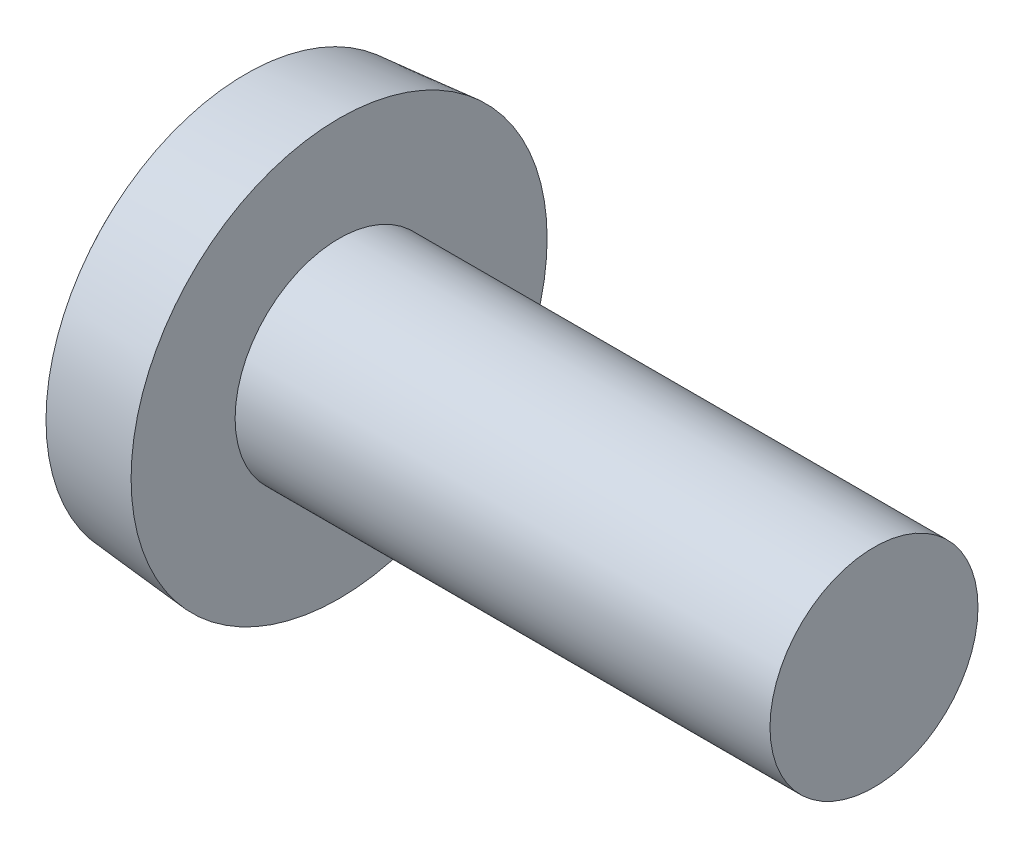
from build123d import *

# Parameters (mm, degrees)
SKETCH_2_R          = 1.75
EXTRUDE_1_DEPTH     = 9
CUT_EXTRUDE_1_DEPTH = 11.889903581


with BuildPart() as part:
    # Sketch 1 → Revolve 1 (revolve)
    with BuildSketch(Plane(origin=(0, 0, 0), x_dir=(-1, 0, 0), z_dir=(0, 0, -1)), mode=Mode.PRIVATE) as revolve_1_sk:
        with BuildLine():
            Line((0, 3.5), (0, 0))
            Line((0, 0), (2.7, 0))
            ThreePointArc((2.7, 0), (2.409707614, 1.773893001), (1.569115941, 3.362720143))
            Line((1.569115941, 3.362720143), (0, 3.5))
        make_face()
    revolve(revolve_1_sk.sketch.rotate(Axis((0, 0, 0), (-1, 0, 0)), 270), axis=Axis((0, 0, 0), (-1, 0, 0)))

    # Sketch 2 → Extrude 1 (add)
    with BuildSketch(Plane(origin=(0, 0, 0), x_dir=(0, 0, -1), z_dir=(1, 0, 0))):
        Circle(SKETCH_2_R)
    extrude(amount=EXTRUDE_1_DEPTH)

    # Sketch 3 → Cut-Extrude 1 (cut, through all)
    with BuildSketch(Plane(origin=(-0.7, 0, 0), x_dir=(0, 0, -1), z_dir=(1, 0, 0))):
        Polygon((-2.25, 0.5), (-2.25, -0.5), (-0.5, -0.5), (-0.5, -2.25), (0.5, -2.25), (0.5, -0.5), (2.25, -0.5), (2.25, 0.5), (0.5, 0.5), (0.5, 2.25), (-0.5, 2.25), (-0.5, 0.5), align=None)
    extrude(amount=-CUT_EXTRUDE_1_DEPTH, mode=Mode.SUBTRACT)


solid = part.part
